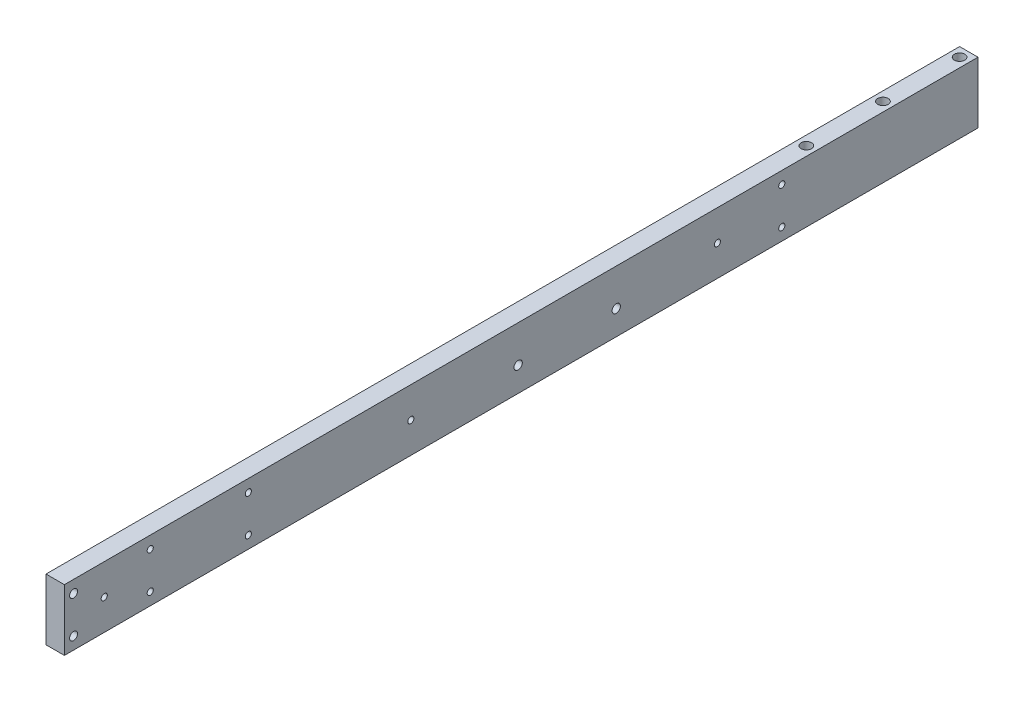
ISO-10303-21;
HEADER;
FILE_DESCRIPTION(('STEP AP214'),'2;1');
FILE_NAME('part.step','',(''),(''),'','','');
FILE_SCHEMA(('AUTOMOTIVE_DESIGN { 1 0 10303 214 1 1 1 1 }'));
ENDSEC;
DATA;
#1=APPLICATION_CONTEXT('core data for automotive mechanical design processes');
#2=APPLICATION_PROTOCOL_DEFINITION('international standard','automotive_design',2000,#1);
#3=PRODUCT_CONTEXT('',#1,'mechanical');
#4=PRODUCT('Part','Part','',(#3));
#5=PRODUCT_RELATED_PRODUCT_CATEGORY('part','',(#4));
#6=PRODUCT_DEFINITION_FORMATION('','',#4);
#7=PRODUCT_DEFINITION_CONTEXT('part definition',#1,'design');
#8=PRODUCT_DEFINITION('design','',#6,#7);
#9=PRODUCT_DEFINITION_SHAPE('','',#8);
#10=(LENGTH_UNIT() NAMED_UNIT(*) SI_UNIT(.MILLI.,.METRE.));
#11=(NAMED_UNIT(*) PLANE_ANGLE_UNIT() SI_UNIT($,.RADIAN.));
#12=(NAMED_UNIT(*) SI_UNIT($,.STERADIAN.) SOLID_ANGLE_UNIT());
#13=UNCERTAINTY_MEASURE_WITH_UNIT(LENGTH_MEASURE(1.E-05),#10,'distance_accuracy_value','');
#14=(GEOMETRIC_REPRESENTATION_CONTEXT(3) GLOBAL_UNCERTAINTY_ASSIGNED_CONTEXT((#13)) GLOBAL_UNIT_ASSIGNED_CONTEXT((#10,
#11,#12)) REPRESENTATION_CONTEXT('',''));
#15=CARTESIAN_POINT('',(0.,0.,0.));
#16=DIRECTION('',(0.,0.,1.));
#17=DIRECTION('',(1.,0.,0.));
#18=AXIS2_PLACEMENT_3D('',#15,#16,#17);
#19=CARTESIAN_POINT('',(0.,0.,-745.));
#20=DIRECTION('',(-1.,0.,0.));
#21=DIRECTION('',(0.,0.,1.));
#22=AXIS2_PLACEMENT_3D('',#19,#20,#21);
#23=PLANE('',#22);
#24=CARTESIAN_POINT('',(0.,20.0000000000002,-450.));
#25=DIRECTION('',(1.,0.,0.));
#26=DIRECTION('',(0.,0.,-1.));
#27=AXIS2_PLACEMENT_3D('',#24,#25,#26);
#28=CIRCLE('',#27,3.4);
#29=CARTESIAN_POINT('',(0.,20.0000000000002,-453.4));
#30=VERTEX_POINT('',#29);
#31=EDGE_CURVE('E305',#30,#30,#28,.T.);
#32=ORIENTED_EDGE('',*,*,#31,.T.);
#33=EDGE_LOOP('',(#32));
#34=FACE_BOUND('',#33,.T.);
#35=CARTESIAN_POINT('',(0.,10.,-150.));
#36=DIRECTION('',(1.,0.,0.));
#37=DIRECTION('',(0.,0.,-1.));
#38=AXIS2_PLACEMENT_3D('',#35,#36,#37);
#39=CIRCLE('',#38,2.5);
#40=CARTESIAN_POINT('',(0.,10.,-152.5));
#41=VERTEX_POINT('',#40);
#42=EDGE_CURVE('E205',#41,#41,#39,.T.);
#43=ORIENTED_EDGE('',*,*,#42,.T.);
#44=EDGE_LOOP('',(#43));
#45=FACE_BOUND('',#44,.T.);
#46=CARTESIAN_POINT('',(0.,10.,-7.49999999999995));
#47=DIRECTION('',(-1.,0.,0.));
#48=DIRECTION('',(0.,0.,1.));
#49=AXIS2_PLACEMENT_3D('',#46,#47,#48);
#50=CIRCLE('',#49,6.);
#51=CARTESIAN_POINT('',(0.,10.,-1.49999999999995));
#52=VERTEX_POINT('',#51);
#53=EDGE_CURVE('E225',#52,#52,#50,.T.);
#54=ORIENTED_EDGE('',*,*,#53,.F.);
#55=EDGE_LOOP('',(#54));
#56=FACE_BOUND('',#55,.T.);
#57=CARTESIAN_POINT('',(0.,40.,-7.49999999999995));
#58=DIRECTION('',(-1.,0.,0.));
#59=DIRECTION('',(0.,0.,1.));
#60=AXIS2_PLACEMENT_3D('',#57,#58,#59);
#61=CIRCLE('',#60,6.);
#62=CARTESIAN_POINT('',(0.,40.,-1.49999999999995));
#63=VERTEX_POINT('',#62);
#64=EDGE_CURVE('E132',#63,#63,#61,.T.);
#65=ORIENTED_EDGE('',*,*,#64,.F.);
#66=EDGE_LOOP('',(#65));
#67=FACE_BOUND('',#66,.T.);
#68=DIRECTION('',(0.,-1.,0.));
#69=VECTOR('',#68,1.);
#70=CARTESIAN_POINT('',(0.,0.,0.));
#71=LINE('',#70,#69);
#72=CARTESIAN_POINT('',(0.,50.,0.));
#73=VERTEX_POINT('',#72);
#74=CARTESIAN_POINT('',(0.,0.,0.));
#75=VERTEX_POINT('',#74);
#76=EDGE_CURVE('E82',#73,#75,#71,.T.);
#77=ORIENTED_EDGE('',*,*,#76,.F.);
#78=DIRECTION('',(0.,0.,1.));
#79=VECTOR('',#78,1.);
#80=CARTESIAN_POINT('',(0.,50.,-745.));
#81=LINE('',#80,#79);
#82=CARTESIAN_POINT('',(0.,50.,-745.));
#83=VERTEX_POINT('',#82);
#84=EDGE_CURVE('E11',#83,#73,#81,.T.);
#85=ORIENTED_EDGE('',*,*,#84,.F.);
#86=DIRECTION('',(0.,-1.,0.));
#87=VECTOR('',#86,1.);
#88=CARTESIAN_POINT('',(0.,0.,-745.));
#89=LINE('',#88,#87);
#90=CARTESIAN_POINT('',(0.,0.,-745.));
#91=VERTEX_POINT('',#90);
#92=EDGE_CURVE('E84',#83,#91,#89,.T.);
#93=ORIENTED_EDGE('',*,*,#92,.T.);
#94=DIRECTION('',(0.,0.,1.));
#95=VECTOR('',#94,1.);
#96=CARTESIAN_POINT('',(0.,0.,-745.));
#97=LINE('',#96,#95);
#98=EDGE_CURVE('E43',#91,#75,#97,.T.);
#99=ORIENTED_EDGE('',*,*,#98,.T.);
#100=EDGE_LOOP('',(#77,#85,#93,#99));
#101=FACE_BOUND('',#100,.T.);
#102=CARTESIAN_POINT('',(0.,40.,-150.));
#103=DIRECTION('',(1.,0.,0.));
#104=DIRECTION('',(0.,0.,-1.));
#105=AXIS2_PLACEMENT_3D('',#102,#103,#104);
#106=CIRCLE('',#105,2.5);
#107=CARTESIAN_POINT('',(0.,40.,-152.5));
#108=VERTEX_POINT('',#107);
#109=EDGE_CURVE('E197',#108,#108,#106,.T.);
#110=ORIENTED_EDGE('',*,*,#109,.T.);
#111=EDGE_LOOP('',(#110));
#112=FACE_BOUND('',#111,.T.);
#113=CARTESIAN_POINT('',(0.,40.,-70.));
#114=DIRECTION('',(1.,0.,0.));
#115=DIRECTION('',(0.,0.,-1.));
#116=AXIS2_PLACEMENT_3D('',#113,#114,#115);
#117=CIRCLE('',#116,2.5);
#118=CARTESIAN_POINT('',(0.,40.,-72.5));
#119=VERTEX_POINT('',#118);
#120=EDGE_CURVE('E134',#119,#119,#117,.T.);
#121=ORIENTED_EDGE('',*,*,#120,.T.);
#122=EDGE_LOOP('',(#121));
#123=FACE_BOUND('',#122,.T.);
#124=CARTESIAN_POINT('',(0.,10.,-70.));
#125=DIRECTION('',(1.,0.,0.));
#126=DIRECTION('',(0.,0.,-1.));
#127=AXIS2_PLACEMENT_3D('',#124,#125,#126);
#128=CIRCLE('',#127,2.5);
#129=CARTESIAN_POINT('',(0.,10.,-72.5));
#130=VERTEX_POINT('',#129);
#131=EDGE_CURVE('E187',#130,#130,#128,.T.);
#132=ORIENTED_EDGE('',*,*,#131,.T.);
#133=EDGE_LOOP('',(#132));
#134=FACE_BOUND('',#133,.T.);
#135=CARTESIAN_POINT('',(0.,10.,-585.));
#136=DIRECTION('',(1.,0.,0.));
#137=DIRECTION('',(0.,0.,-1.));
#138=AXIS2_PLACEMENT_3D('',#135,#136,#137);
#139=CIRCLE('',#138,2.5);
#140=CARTESIAN_POINT('',(0.,10.,-587.5));
#141=VERTEX_POINT('',#140);
#142=EDGE_CURVE('E179',#141,#141,#139,.T.);
#143=ORIENTED_EDGE('',*,*,#142,.T.);
#144=EDGE_LOOP('',(#143));
#145=FACE_BOUND('',#144,.T.);
#146=CARTESIAN_POINT('',(0.,40.,-585.));
#147=DIRECTION('',(1.,0.,0.));
#148=DIRECTION('',(0.,0.,-1.));
#149=AXIS2_PLACEMENT_3D('',#146,#147,#148);
#150=CIRCLE('',#149,2.5);
#151=CARTESIAN_POINT('',(0.,40.,-587.5));
#152=VERTEX_POINT('',#151);
#153=EDGE_CURVE('E171',#152,#152,#150,.T.);
#154=ORIENTED_EDGE('',*,*,#153,.T.);
#155=EDGE_LOOP('',(#154));
#156=FACE_BOUND('',#155,.T.);
#157=CARTESIAN_POINT('',(0.,25.,-32.5));
#158=DIRECTION('',(-1.,0.,0.));
#159=DIRECTION('',(0.,0.,1.));
#160=AXIS2_PLACEMENT_3D('',#157,#158,#159);
#161=CIRCLE('',#160,2.5);
#162=CARTESIAN_POINT('',(0.,25.,-30.));
#163=VERTEX_POINT('',#162);
#164=EDGE_CURVE('E167',#163,#163,#161,.T.);
#165=ORIENTED_EDGE('',*,*,#164,.F.);
#166=EDGE_LOOP('',(#165));
#167=FACE_BOUND('',#166,.T.);
#168=CARTESIAN_POINT('',(0.,25.,-282.5));
#169=DIRECTION('',(-1.,0.,0.));
#170=DIRECTION('',(0.,0.,1.));
#171=AXIS2_PLACEMENT_3D('',#168,#169,#170);
#172=CIRCLE('',#171,2.5);
#173=CARTESIAN_POINT('',(0.,25.,-280.));
#174=VERTEX_POINT('',#173);
#175=EDGE_CURVE('E154',#174,#174,#172,.T.);
#176=ORIENTED_EDGE('',*,*,#175,.F.);
#177=EDGE_LOOP('',(#176));
#178=FACE_BOUND('',#177,.T.);
#179=CARTESIAN_POINT('',(0.,25.,-532.5));
#180=DIRECTION('',(-1.,0.,0.));
#181=DIRECTION('',(0.,0.,1.));
#182=AXIS2_PLACEMENT_3D('',#179,#180,#181);
#183=CIRCLE('',#182,2.5);
#184=CARTESIAN_POINT('',(0.,25.,-530.));
#185=VERTEX_POINT('',#184);
#186=EDGE_CURVE('E145',#185,#185,#183,.T.);
#187=ORIENTED_EDGE('',*,*,#186,.F.);
#188=EDGE_LOOP('',(#187));
#189=FACE_BOUND('',#188,.T.);
#190=CARTESIAN_POINT('',(0.,20.,-370.));
#191=DIRECTION('',(1.,0.,0.));
#192=DIRECTION('',(0.,0.,-1.));
#193=AXIS2_PLACEMENT_3D('',#190,#191,#192);
#194=CIRCLE('',#193,3.4);
#195=CARTESIAN_POINT('',(0.,20.,-373.4));
#196=VERTEX_POINT('',#195);
#197=EDGE_CURVE('E585',#196,#196,#194,.T.);
#198=ORIENTED_EDGE('',*,*,#197,.T.);
#199=EDGE_LOOP('',(#198));
#200=FACE_BOUND('',#199,.T.);
#201=ADVANCED_FACE('F40',(#34,#45,#56,#67,#101,#112,#123,#134,#145,#156,#167,#178,#189,#200),
#23,.T.);
#202=CARTESIAN_POINT('',(15.,0.,-745.));
#203=DIRECTION('',(1.,0.,0.));
#204=DIRECTION('',(0.,0.,-1.));
#205=AXIS2_PLACEMENT_3D('',#202,#203,#204);
#206=PLANE('',#205);
#207=CARTESIAN_POINT('',(15.,20.0000000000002,-450.));
#208=DIRECTION('',(1.,0.,0.));
#209=DIRECTION('',(0.,0.,-1.));
#210=AXIS2_PLACEMENT_3D('',#207,#208,#209);
#211=CIRCLE('',#210,3.39999999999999);
#212=CARTESIAN_POINT('',(15.,20.0000000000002,-453.4));
#213=VERTEX_POINT('',#212);
#214=EDGE_CURVE('E583',#213,#213,#211,.T.);
#215=ORIENTED_EDGE('',*,*,#214,.F.);
#216=EDGE_LOOP('',(#215));
#217=FACE_BOUND('',#216,.T.);
#218=CARTESIAN_POINT('',(15.,20.,-370.));
#219=DIRECTION('',(1.,0.,0.));
#220=DIRECTION('',(0.,0.,-1.));
#221=AXIS2_PLACEMENT_3D('',#218,#219,#220);
#222=CIRCLE('',#221,3.39999999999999);
#223=CARTESIAN_POINT('',(15.,20.,-373.4));
#224=VERTEX_POINT('',#223);
#225=EDGE_CURVE('E157',#224,#224,#222,.T.);
#226=ORIENTED_EDGE('',*,*,#225,.F.);
#227=EDGE_LOOP('',(#226));
#228=FACE_BOUND('',#227,.T.);
#229=CARTESIAN_POINT('',(15.,25.,-282.5));
#230=DIRECTION('',(-1.,0.,0.));
#231=DIRECTION('',(0.,0.,1.));
#232=AXIS2_PLACEMENT_3D('',#229,#230,#231);
#233=CIRCLE('',#232,2.5);
#234=CARTESIAN_POINT('',(15.,25.,-280.));
#235=VERTEX_POINT('',#234);
#236=EDGE_CURVE('E147',#235,#235,#233,.T.);
#237=ORIENTED_EDGE('',*,*,#236,.T.);
#238=EDGE_LOOP('',(#237));
#239=FACE_BOUND('',#238,.T.);
#240=CARTESIAN_POINT('',(15.,25.,-32.5));
#241=DIRECTION('',(-1.,0.,0.));
#242=DIRECTION('',(0.,0.,1.));
#243=AXIS2_PLACEMENT_3D('',#240,#241,#242);
#244=CIRCLE('',#243,2.5);
#245=CARTESIAN_POINT('',(15.,25.,-30.));
#246=VERTEX_POINT('',#245);
#247=EDGE_CURVE('E163',#246,#246,#244,.T.);
#248=ORIENTED_EDGE('',*,*,#247,.T.);
#249=EDGE_LOOP('',(#248));
#250=FACE_BOUND('',#249,.T.);
#251=CARTESIAN_POINT('',(15.,40.,-585.));
#252=DIRECTION('',(1.,0.,0.));
#253=DIRECTION('',(0.,0.,-1.));
#254=AXIS2_PLACEMENT_3D('',#251,#252,#253);
#255=CIRCLE('',#254,2.49999999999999);
#256=CARTESIAN_POINT('',(15.,40.,-587.5));
#257=VERTEX_POINT('',#256);
#258=EDGE_CURVE('E175',#257,#257,#255,.T.);
#259=ORIENTED_EDGE('',*,*,#258,.F.);
#260=EDGE_LOOP('',(#259));
#261=FACE_BOUND('',#260,.T.);
#262=CARTESIAN_POINT('',(15.,10.,-585.));
#263=DIRECTION('',(1.,0.,0.));
#264=DIRECTION('',(0.,0.,-1.));
#265=AXIS2_PLACEMENT_3D('',#262,#263,#264);
#266=CIRCLE('',#265,2.49999999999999);
#267=CARTESIAN_POINT('',(15.,10.,-587.5));
#268=VERTEX_POINT('',#267);
#269=EDGE_CURVE('E183',#268,#268,#266,.T.);
#270=ORIENTED_EDGE('',*,*,#269,.F.);
#271=EDGE_LOOP('',(#270));
#272=FACE_BOUND('',#271,.T.);
#273=CARTESIAN_POINT('',(15.,10.,-70.));
#274=DIRECTION('',(1.,0.,0.));
#275=DIRECTION('',(0.,0.,-1.));
#276=AXIS2_PLACEMENT_3D('',#273,#274,#275);
#277=CIRCLE('',#276,2.49999999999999);
#278=CARTESIAN_POINT('',(15.,10.,-72.4999999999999));
#279=VERTEX_POINT('',#278);
#280=EDGE_CURVE('E137',#279,#279,#277,.T.);
#281=ORIENTED_EDGE('',*,*,#280,.F.);
#282=EDGE_LOOP('',(#281));
#283=FACE_BOUND('',#282,.T.);
#284=CARTESIAN_POINT('',(15.,40.,-70.));
#285=DIRECTION('',(1.,0.,0.));
#286=DIRECTION('',(0.,0.,-1.));
#287=AXIS2_PLACEMENT_3D('',#284,#285,#286);
#288=CIRCLE('',#287,2.49999999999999);
#289=CARTESIAN_POINT('',(15.,40.,-72.4999999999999));
#290=VERTEX_POINT('',#289);
#291=EDGE_CURVE('E136',#290,#290,#288,.T.);
#292=ORIENTED_EDGE('',*,*,#291,.F.);
#293=EDGE_LOOP('',(#292));
#294=FACE_BOUND('',#293,.T.);
#295=CARTESIAN_POINT('',(15.,40.,-150.));
#296=DIRECTION('',(1.,0.,0.));
#297=DIRECTION('',(0.,0.,-1.));
#298=AXIS2_PLACEMENT_3D('',#295,#296,#297);
#299=CIRCLE('',#298,2.49999999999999);
#300=CARTESIAN_POINT('',(15.,40.,-152.5));
#301=VERTEX_POINT('',#300);
#302=EDGE_CURVE('E201',#301,#301,#299,.T.);
#303=ORIENTED_EDGE('',*,*,#302,.F.);
#304=EDGE_LOOP('',(#303));
#305=FACE_BOUND('',#304,.T.);
#306=CARTESIAN_POINT('',(15.,10.,-150.));
#307=DIRECTION('',(1.,0.,0.));
#308=DIRECTION('',(0.,0.,-1.));
#309=AXIS2_PLACEMENT_3D('',#306,#307,#308);
#310=CIRCLE('',#309,2.49999999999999);
#311=CARTESIAN_POINT('',(15.,10.,-152.5));
#312=VERTEX_POINT('',#311);
#313=EDGE_CURVE('E209',#312,#312,#310,.T.);
#314=ORIENTED_EDGE('',*,*,#313,.F.);
#315=EDGE_LOOP('',(#314));
#316=FACE_BOUND('',#315,.T.);
#317=DIRECTION('',(0.,1.,0.));
#318=VECTOR('',#317,1.);
#319=CARTESIAN_POINT('',(15.,0.,0.));
#320=LINE('',#319,#318);
#321=CARTESIAN_POINT('',(15.,0.,0.));
#322=VERTEX_POINT('',#321);
#323=CARTESIAN_POINT('',(15.,50.,0.));
#324=VERTEX_POINT('',#323);
#325=EDGE_CURVE('E99',#322,#324,#320,.T.);
#326=ORIENTED_EDGE('',*,*,#325,.F.);
#327=DIRECTION('',(0.,0.,1.));
#328=VECTOR('',#327,1.);
#329=CARTESIAN_POINT('',(15.,0.,-745.));
#330=LINE('',#329,#328);
#331=CARTESIAN_POINT('',(15.,0.,-745.));
#332=VERTEX_POINT('',#331);
#333=EDGE_CURVE('E89',#332,#322,#330,.T.);
#334=ORIENTED_EDGE('',*,*,#333,.F.);
#335=DIRECTION('',(0.,1.,0.));
#336=VECTOR('',#335,1.);
#337=CARTESIAN_POINT('',(15.,0.,-745.));
#338=LINE('',#337,#336);
#339=CARTESIAN_POINT('',(15.,50.,-745.));
#340=VERTEX_POINT('',#339);
#341=EDGE_CURVE('E123',#332,#340,#338,.T.);
#342=ORIENTED_EDGE('',*,*,#341,.T.);
#343=DIRECTION('',(0.,0.,1.));
#344=VECTOR('',#343,1.);
#345=CARTESIAN_POINT('',(15.,50.,-745.));
#346=LINE('',#345,#344);
#347=EDGE_CURVE('E49',#340,#324,#346,.T.);
#348=ORIENTED_EDGE('',*,*,#347,.T.);
#349=EDGE_LOOP('',(#326,#334,#342,#348));
#350=FACE_BOUND('',#349,.T.);
#351=CARTESIAN_POINT('',(15.,40.,-7.49999999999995));
#352=DIRECTION('',(-1.,0.,0.));
#353=DIRECTION('',(0.,0.,1.));
#354=AXIS2_PLACEMENT_3D('',#351,#352,#353);
#355=CIRCLE('',#354,3.25);
#356=CARTESIAN_POINT('',(15.,40.,-4.24999999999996));
#357=VERTEX_POINT('',#356);
#358=EDGE_CURVE('E229',#357,#357,#355,.T.);
#359=ORIENTED_EDGE('',*,*,#358,.T.);
#360=EDGE_LOOP('',(#359));
#361=FACE_BOUND('',#360,.T.);
#362=CARTESIAN_POINT('',(15.,10.,-7.49999999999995));
#363=DIRECTION('',(-1.,0.,0.));
#364=DIRECTION('',(0.,0.,1.));
#365=AXIS2_PLACEMENT_3D('',#362,#363,#364);
#366=CIRCLE('',#365,3.25);
#367=CARTESIAN_POINT('',(15.,10.,-4.24999999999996));
#368=VERTEX_POINT('',#367);
#369=EDGE_CURVE('E213',#368,#368,#366,.T.);
#370=ORIENTED_EDGE('',*,*,#369,.T.);
#371=EDGE_LOOP('',(#370));
#372=FACE_BOUND('',#371,.T.);
#373=CARTESIAN_POINT('',(15.,25.,-532.5));
#374=DIRECTION('',(-1.,0.,0.));
#375=DIRECTION('',(0.,0.,1.));
#376=AXIS2_PLACEMENT_3D('',#373,#374,#375);
#377=CIRCLE('',#376,2.5);
#378=CARTESIAN_POINT('',(15.,25.,-530.));
#379=VERTEX_POINT('',#378);
#380=EDGE_CURVE('E148',#379,#379,#377,.T.);
#381=ORIENTED_EDGE('',*,*,#380,.T.);
#382=EDGE_LOOP('',(#381));
#383=FACE_BOUND('',#382,.T.);
#384=ADVANCED_FACE('F272',(#217,#228,#239,#250,#261,#272,#283,#294,#305,#316,#350,#361,#372,
#383),#206,.T.);
#385=CARTESIAN_POINT('',(0.,0.,-745.));
#386=DIRECTION('',(0.,-1.,0.));
#387=DIRECTION('',(0.,0.,-1.));
#388=AXIS2_PLACEMENT_3D('',#385,#386,#387);
#389=PLANE('',#388);
#390=CARTESIAN_POINT('',(7.49999999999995,0.,-675.));
#391=DIRECTION('',(0.,1.,0.));
#392=DIRECTION('',(0.,0.,1.));
#393=AXIS2_PLACEMENT_3D('',#390,#391,#392);
#394=CIRCLE('',#393,4.24999999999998);
#395=CARTESIAN_POINT('',(7.49999999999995,0.,-670.75));
#396=VERTEX_POINT('',#395);
#397=EDGE_CURVE('E143',#396,#396,#394,.T.);
#398=ORIENTED_EDGE('',*,*,#397,.T.);
#399=EDGE_LOOP('',(#398));
#400=FACE_BOUND('',#399,.T.);
#401=CARTESIAN_POINT('',(7.49999999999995,0.,-737.5));
#402=DIRECTION('',(0.,1.,0.));
#403=DIRECTION('',(0.,0.,1.));
#404=AXIS2_PLACEMENT_3D('',#401,#402,#403);
#405=CIRCLE('',#404,4.24999999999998);
#406=CARTESIAN_POINT('',(7.49999999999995,0.,-733.25));
#407=VERTEX_POINT('',#406);
#408=EDGE_CURVE('E142',#407,#407,#405,.T.);
#409=ORIENTED_EDGE('',*,*,#408,.T.);
#410=EDGE_LOOP('',(#409));
#411=FACE_BOUND('',#410,.T.);
#412=DIRECTION('',(1.,0.,0.));
#413=VECTOR('',#412,1.);
#414=CARTESIAN_POINT('',(0.,0.,0.));
#415=LINE('',#414,#413);
#416=EDGE_CURVE('E92',#75,#322,#415,.T.);
#417=ORIENTED_EDGE('',*,*,#416,.F.);
#418=ORIENTED_EDGE('',*,*,#98,.F.);
#419=DIRECTION('',(1.,0.,0.));
#420=VECTOR('',#419,1.);
#421=CARTESIAN_POINT('',(0.,0.,-745.));
#422=LINE('',#421,#420);
#423=EDGE_CURVE('E120',#91,#332,#422,.T.);
#424=ORIENTED_EDGE('',*,*,#423,.T.);
#425=ORIENTED_EDGE('',*,*,#333,.T.);
#426=EDGE_LOOP('',(#417,#418,#424,#425));
#427=FACE_BOUND('',#426,.T.);
#428=CARTESIAN_POINT('',(7.49999999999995,0.,-612.5));
#429=DIRECTION('',(0.,1.,0.));
#430=DIRECTION('',(0.,0.,1.));
#431=AXIS2_PLACEMENT_3D('',#428,#429,#430);
#432=CIRCLE('',#431,4.24999999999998);
#433=CARTESIAN_POINT('',(7.49999999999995,0.,-608.25));
#434=VERTEX_POINT('',#433);
#435=EDGE_CURVE('E110',#434,#434,#432,.T.);
#436=ORIENTED_EDGE('',*,*,#435,.T.);
#437=EDGE_LOOP('',(#436));
#438=FACE_BOUND('',#437,.T.);
#439=ADVANCED_FACE('F93',(#400,#411,#427,#438),#389,.T.);
#440=CARTESIAN_POINT('',(0.,50.,-745.));
#441=DIRECTION('',(0.,1.,0.));
#442=DIRECTION('',(0.,0.,1.));
#443=AXIS2_PLACEMENT_3D('',#440,#441,#442);
#444=PLANE('',#443);
#445=CARTESIAN_POINT('',(7.49999999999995,50.,-675.));
#446=DIRECTION('',(0.,1.,0.));
#447=DIRECTION('',(0.,0.,1.));
#448=AXIS2_PLACEMENT_3D('',#445,#446,#447);
#449=CIRCLE('',#448,4.24999999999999);
#450=CARTESIAN_POINT('',(7.49999999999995,50.,-670.75));
#451=VERTEX_POINT('',#450);
#452=EDGE_CURVE('E140',#451,#451,#449,.T.);
#453=ORIENTED_EDGE('',*,*,#452,.F.);
#454=EDGE_LOOP('',(#453));
#455=FACE_BOUND('',#454,.T.);
#456=CARTESIAN_POINT('',(7.49999999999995,50.,-737.5));
#457=DIRECTION('',(0.,1.,0.));
#458=DIRECTION('',(0.,0.,1.));
#459=AXIS2_PLACEMENT_3D('',#456,#457,#458);
#460=CIRCLE('',#459,4.24999999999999);
#461=CARTESIAN_POINT('',(7.49999999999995,50.,-733.25));
#462=VERTEX_POINT('',#461);
#463=EDGE_CURVE('E249',#462,#462,#460,.T.);
#464=ORIENTED_EDGE('',*,*,#463,.F.);
#465=EDGE_LOOP('',(#464));
#466=FACE_BOUND('',#465,.T.);
#467=CARTESIAN_POINT('',(7.49999999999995,50.,-612.5));
#468=DIRECTION('',(0.,1.,0.));
#469=DIRECTION('',(0.,0.,1.));
#470=AXIS2_PLACEMENT_3D('',#467,#468,#469);
#471=CIRCLE('',#470,4.24999999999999);
#472=CARTESIAN_POINT('',(7.49999999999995,50.,-608.25));
#473=VERTEX_POINT('',#472);
#474=EDGE_CURVE('E104',#473,#473,#471,.T.);
#475=ORIENTED_EDGE('',*,*,#474,.F.);
#476=EDGE_LOOP('',(#475));
#477=FACE_BOUND('',#476,.T.);
#478=DIRECTION('',(-1.,0.,0.));
#479=VECTOR('',#478,1.);
#480=CARTESIAN_POINT('',(0.,50.,0.));
#481=LINE('',#480,#479);
#482=EDGE_CURVE('E102',#324,#73,#481,.T.);
#483=ORIENTED_EDGE('',*,*,#482,.F.);
#484=ORIENTED_EDGE('',*,*,#347,.F.);
#485=DIRECTION('',(-1.,0.,0.));
#486=VECTOR('',#485,1.);
#487=CARTESIAN_POINT('',(0.,50.,-745.));
#488=LINE('',#487,#486);
#489=EDGE_CURVE('E90',#340,#83,#488,.T.);
#490=ORIENTED_EDGE('',*,*,#489,.T.);
#491=ORIENTED_EDGE('',*,*,#84,.T.);
#492=EDGE_LOOP('',(#483,#484,#490,#491));
#493=FACE_BOUND('',#492,.T.);
#494=ADVANCED_FACE('F263',(#455,#466,#477,#493),#444,.T.);
#495=CARTESIAN_POINT('',(0.,50.,-745.));
#496=DIRECTION('',(0.,0.,-1.));
#497=DIRECTION('',(-1.,0.,0.));
#498=AXIS2_PLACEMENT_3D('',#495,#496,#497);
#499=PLANE('',#498);
#500=ORIENTED_EDGE('',*,*,#92,.F.);
#501=ORIENTED_EDGE('',*,*,#489,.F.);
#502=ORIENTED_EDGE('',*,*,#341,.F.);
#503=ORIENTED_EDGE('',*,*,#423,.F.);
#504=EDGE_LOOP('',(#500,#501,#502,#503));
#505=FACE_BOUND('',#504,.T.);
#506=ADVANCED_FACE('F265',(#505),#499,.T.);
#507=CARTESIAN_POINT('',(0.,50.,0.));
#508=DIRECTION('',(0.,0.,-1.));
#509=DIRECTION('',(-1.,0.,0.));
#510=AXIS2_PLACEMENT_3D('',#507,#508,#509);
#511=PLANE('',#510);
#512=ORIENTED_EDGE('',*,*,#76,.T.);
#513=ORIENTED_EDGE('',*,*,#416,.T.);
#514=ORIENTED_EDGE('',*,*,#325,.T.);
#515=ORIENTED_EDGE('',*,*,#482,.T.);
#516=EDGE_LOOP('',(#512,#513,#514,#515));
#517=FACE_BOUND('',#516,.T.);
#518=ADVANCED_FACE('F101',(#517),#511,.F.);
#519=CARTESIAN_POINT('',(7.49999999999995,50.,-612.5));
#520=DIRECTION('',(0.,1.,0.));
#521=DIRECTION('',(0.,0.,1.));
#522=AXIS2_PLACEMENT_3D('',#519,#520,#521);
#523=CYLINDRICAL_SURFACE('',#522,4.24999999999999);
#524=ORIENTED_EDGE('',*,*,#435,.F.);
#525=EDGE_LOOP('',(#524));
#526=FACE_BOUND('',#525,.T.);
#527=ORIENTED_EDGE('',*,*,#474,.T.);
#528=EDGE_LOOP('',(#527));
#529=FACE_BOUND('',#528,.T.);
#530=ADVANCED_FACE('F256',(#526,#529),#523,.F.);
#531=CARTESIAN_POINT('',(7.49999999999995,50.,-737.5));
#532=DIRECTION('',(0.,1.,0.));
#533=DIRECTION('',(0.,0.,1.));
#534=AXIS2_PLACEMENT_3D('',#531,#532,#533);
#535=CYLINDRICAL_SURFACE('',#534,4.24999999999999);
#536=ORIENTED_EDGE('',*,*,#408,.F.);
#537=EDGE_LOOP('',(#536));
#538=FACE_BOUND('',#537,.T.);
#539=ORIENTED_EDGE('',*,*,#463,.T.);
#540=EDGE_LOOP('',(#539));
#541=FACE_BOUND('',#540,.T.);
#542=ADVANCED_FACE('F259',(#538,#541),#535,.F.);
#543=CARTESIAN_POINT('',(7.49999999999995,50.,-675.));
#544=DIRECTION('',(0.,1.,0.));
#545=DIRECTION('',(0.,0.,1.));
#546=AXIS2_PLACEMENT_3D('',#543,#544,#545);
#547=CYLINDRICAL_SURFACE('',#546,4.24999999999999);
#548=ORIENTED_EDGE('',*,*,#397,.F.);
#549=EDGE_LOOP('',(#548));
#550=FACE_BOUND('',#549,.T.);
#551=ORIENTED_EDGE('',*,*,#452,.T.);
#552=EDGE_LOOP('',(#551));
#553=FACE_BOUND('',#552,.T.);
#554=ADVANCED_FACE('F315',(#550,#553),#547,.F.);
#555=CARTESIAN_POINT('',(0.,40.,-7.49999999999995));
#556=DIRECTION('',(-1.,0.,0.));
#557=DIRECTION('',(0.,0.,1.));
#558=AXIS2_PLACEMENT_3D('',#555,#556,#557);
#559=CYLINDRICAL_SURFACE('',#558,6.);
#560=CARTESIAN_POINT('',(6.00000000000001,40.,-7.49999999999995));
#561=DIRECTION('',(-1.,0.,0.));
#562=DIRECTION('',(0.,0.,1.));
#563=AXIS2_PLACEMENT_3D('',#560,#561,#562);
#564=CIRCLE('',#563,6.);
#565=CARTESIAN_POINT('',(6.00000000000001,40.,-1.49999999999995));
#566=VERTEX_POINT('',#565);
#567=EDGE_CURVE('E237',#566,#566,#564,.T.);
#568=ORIENTED_EDGE('',*,*,#567,.F.);
#569=EDGE_LOOP('',(#568));
#570=FACE_BOUND('',#569,.T.);
#571=ORIENTED_EDGE('',*,*,#64,.T.);
#572=EDGE_LOOP('',(#571));
#573=FACE_BOUND('',#572,.T.);
#574=ADVANCED_FACE('F312',(#570,#573),#559,.F.);
#575=CARTESIAN_POINT('',(6.00000000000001,43.25,-7.49999999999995));
#576=DIRECTION('',(1.,0.,0.));
#577=DIRECTION('',(0.,0.,-1.));
#578=AXIS2_PLACEMENT_3D('',#575,#576,#577);
#579=PLANE('',#578);
#580=CARTESIAN_POINT('',(6.00000000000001,40.,-7.49999999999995));
#581=DIRECTION('',(-1.,0.,0.));
#582=DIRECTION('',(0.,0.,1.));
#583=AXIS2_PLACEMENT_3D('',#580,#581,#582);
#584=CIRCLE('',#583,3.25);
#585=CARTESIAN_POINT('',(6.00000000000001,40.,-4.24999999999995));
#586=VERTEX_POINT('',#585);
#587=EDGE_CURVE('E233',#586,#586,#584,.T.);
#588=ORIENTED_EDGE('',*,*,#587,.F.);
#589=EDGE_LOOP('',(#588));
#590=FACE_BOUND('',#589,.T.);
#591=ORIENTED_EDGE('',*,*,#567,.T.);
#592=EDGE_LOOP('',(#591));
#593=FACE_BOUND('',#592,.T.);
#594=ADVANCED_FACE('F314',(#590,#593),#579,.F.);
#595=CARTESIAN_POINT('',(0.,40.,-7.49999999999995));
#596=DIRECTION('',(-1.,0.,0.));
#597=DIRECTION('',(0.,0.,1.));
#598=AXIS2_PLACEMENT_3D('',#595,#596,#597);
#599=CYLINDRICAL_SURFACE('',#598,3.25);
#600=ORIENTED_EDGE('',*,*,#358,.F.);
#601=EDGE_LOOP('',(#600));
#602=FACE_BOUND('',#601,.T.);
#603=ORIENTED_EDGE('',*,*,#587,.T.);
#604=EDGE_LOOP('',(#603));
#605=FACE_BOUND('',#604,.T.);
#606=ADVANCED_FACE('F322',(#602,#605),#599,.F.);
#607=CARTESIAN_POINT('',(0.,10.,-7.49999999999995));
#608=DIRECTION('',(-1.,0.,0.));
#609=DIRECTION('',(0.,0.,1.));
#610=AXIS2_PLACEMENT_3D('',#607,#608,#609);
#611=CYLINDRICAL_SURFACE('',#610,6.);
#612=CARTESIAN_POINT('',(6.00000000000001,10.,-7.49999999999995));
#613=DIRECTION('',(-1.,0.,0.));
#614=DIRECTION('',(0.,0.,1.));
#615=AXIS2_PLACEMENT_3D('',#612,#613,#614);
#616=CIRCLE('',#615,6.);
#617=CARTESIAN_POINT('',(6.00000000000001,10.,-1.49999999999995));
#618=VERTEX_POINT('',#617);
#619=EDGE_CURVE('E221',#618,#618,#616,.T.);
#620=ORIENTED_EDGE('',*,*,#619,.F.);
#621=EDGE_LOOP('',(#620));
#622=FACE_BOUND('',#621,.T.);
#623=ORIENTED_EDGE('',*,*,#53,.T.);
#624=EDGE_LOOP('',(#623));
#625=FACE_BOUND('',#624,.T.);
#626=ADVANCED_FACE('F390',(#622,#625),#611,.F.);
#627=CARTESIAN_POINT('',(6.00000000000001,13.25,-7.49999999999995));
#628=DIRECTION('',(1.,0.,0.));
#629=DIRECTION('',(0.,0.,-1.));
#630=AXIS2_PLACEMENT_3D('',#627,#628,#629);
#631=PLANE('',#630);
#632=CARTESIAN_POINT('',(6.00000000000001,10.,-7.49999999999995));
#633=DIRECTION('',(-1.,0.,0.));
#634=DIRECTION('',(0.,0.,1.));
#635=AXIS2_PLACEMENT_3D('',#632,#633,#634);
#636=CIRCLE('',#635,3.25);
#637=CARTESIAN_POINT('',(6.00000000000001,10.,-4.24999999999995));
#638=VERTEX_POINT('',#637);
#639=EDGE_CURVE('E217',#638,#638,#636,.T.);
#640=ORIENTED_EDGE('',*,*,#639,.F.);
#641=EDGE_LOOP('',(#640));
#642=FACE_BOUND('',#641,.T.);
#643=ORIENTED_EDGE('',*,*,#619,.T.);
#644=EDGE_LOOP('',(#643));
#645=FACE_BOUND('',#644,.T.);
#646=ADVANCED_FACE('F398',(#642,#645),#631,.F.);
#647=CARTESIAN_POINT('',(0.,10.,-7.49999999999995));
#648=DIRECTION('',(-1.,0.,0.));
#649=DIRECTION('',(0.,0.,1.));
#650=AXIS2_PLACEMENT_3D('',#647,#648,#649);
#651=CYLINDRICAL_SURFACE('',#650,3.25);
#652=ORIENTED_EDGE('',*,*,#369,.F.);
#653=EDGE_LOOP('',(#652));
#654=FACE_BOUND('',#653,.T.);
#655=ORIENTED_EDGE('',*,*,#639,.T.);
#656=EDGE_LOOP('',(#655));
#657=FACE_BOUND('',#656,.T.);
#658=ADVANCED_FACE('F407',(#654,#657),#651,.F.);
#659=CARTESIAN_POINT('',(15.,10.,-150.));
#660=DIRECTION('',(1.,0.,0.));
#661=DIRECTION('',(0.,0.,-1.));
#662=AXIS2_PLACEMENT_3D('',#659,#660,#661);
#663=CYLINDRICAL_SURFACE('',#662,2.49999999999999);
#664=ORIENTED_EDGE('',*,*,#42,.F.);
#665=EDGE_LOOP('',(#664));
#666=FACE_BOUND('',#665,.T.);
#667=ORIENTED_EDGE('',*,*,#313,.T.);
#668=EDGE_LOOP('',(#667));
#669=FACE_BOUND('',#668,.T.);
#670=ADVANCED_FACE('F416',(#666,#669),#663,.F.);
#671=CARTESIAN_POINT('',(15.,40.,-150.));
#672=DIRECTION('',(1.,0.,0.));
#673=DIRECTION('',(0.,0.,-1.));
#674=AXIS2_PLACEMENT_3D('',#671,#672,#673);
#675=CYLINDRICAL_SURFACE('',#674,2.49999999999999);
#676=ORIENTED_EDGE('',*,*,#109,.F.);
#677=EDGE_LOOP('',(#676));
#678=FACE_BOUND('',#677,.T.);
#679=ORIENTED_EDGE('',*,*,#302,.T.);
#680=EDGE_LOOP('',(#679));
#681=FACE_BOUND('',#680,.T.);
#682=ADVANCED_FACE('F426',(#678,#681),#675,.F.);
#683=CARTESIAN_POINT('',(15.,40.,-70.));
#684=DIRECTION('',(1.,0.,0.));
#685=DIRECTION('',(0.,0.,-1.));
#686=AXIS2_PLACEMENT_3D('',#683,#684,#685);
#687=CYLINDRICAL_SURFACE('',#686,2.49999999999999);
#688=ORIENTED_EDGE('',*,*,#120,.F.);
#689=EDGE_LOOP('',(#688));
#690=FACE_BOUND('',#689,.T.);
#691=ORIENTED_EDGE('',*,*,#291,.T.);
#692=EDGE_LOOP('',(#691));
#693=FACE_BOUND('',#692,.T.);
#694=ADVANCED_FACE('F436',(#690,#693),#687,.F.);
#695=CARTESIAN_POINT('',(15.,10.,-70.));
#696=DIRECTION('',(1.,0.,0.));
#697=DIRECTION('',(0.,0.,-1.));
#698=AXIS2_PLACEMENT_3D('',#695,#696,#697);
#699=CYLINDRICAL_SURFACE('',#698,2.49999999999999);
#700=ORIENTED_EDGE('',*,*,#131,.F.);
#701=EDGE_LOOP('',(#700));
#702=FACE_BOUND('',#701,.T.);
#703=ORIENTED_EDGE('',*,*,#280,.T.);
#704=EDGE_LOOP('',(#703));
#705=FACE_BOUND('',#704,.T.);
#706=ADVANCED_FACE('F446',(#702,#705),#699,.F.);
#707=CARTESIAN_POINT('',(15.,10.,-585.));
#708=DIRECTION('',(1.,0.,0.));
#709=DIRECTION('',(0.,0.,-1.));
#710=AXIS2_PLACEMENT_3D('',#707,#708,#709);
#711=CYLINDRICAL_SURFACE('',#710,2.49999999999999);
#712=ORIENTED_EDGE('',*,*,#142,.F.);
#713=EDGE_LOOP('',(#712));
#714=FACE_BOUND('',#713,.T.);
#715=ORIENTED_EDGE('',*,*,#269,.T.);
#716=EDGE_LOOP('',(#715));
#717=FACE_BOUND('',#716,.T.);
#718=ADVANCED_FACE('F456',(#714,#717),#711,.F.);
#719=CARTESIAN_POINT('',(15.,40.,-585.));
#720=DIRECTION('',(1.,0.,0.));
#721=DIRECTION('',(0.,0.,-1.));
#722=AXIS2_PLACEMENT_3D('',#719,#720,#721);
#723=CYLINDRICAL_SURFACE('',#722,2.49999999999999);
#724=ORIENTED_EDGE('',*,*,#153,.F.);
#725=EDGE_LOOP('',(#724));
#726=FACE_BOUND('',#725,.T.);
#727=ORIENTED_EDGE('',*,*,#258,.T.);
#728=EDGE_LOOP('',(#727));
#729=FACE_BOUND('',#728,.T.);
#730=ADVANCED_FACE('F466',(#726,#729),#723,.F.);
#731=CARTESIAN_POINT('',(0.,25.,-32.5));
#732=DIRECTION('',(-1.,0.,0.));
#733=DIRECTION('',(0.,0.,1.));
#734=AXIS2_PLACEMENT_3D('',#731,#732,#733);
#735=CYLINDRICAL_SURFACE('',#734,2.5);
#736=ORIENTED_EDGE('',*,*,#247,.F.);
#737=EDGE_LOOP('',(#736));
#738=FACE_BOUND('',#737,.T.);
#739=ORIENTED_EDGE('',*,*,#164,.T.);
#740=EDGE_LOOP('',(#739));
#741=FACE_BOUND('',#740,.T.);
#742=ADVANCED_FACE('F295',(#738,#741),#735,.F.);
#743=CARTESIAN_POINT('',(0.,25.,-282.5));
#744=DIRECTION('',(-1.,0.,0.));
#745=DIRECTION('',(0.,0.,1.));
#746=AXIS2_PLACEMENT_3D('',#743,#744,#745);
#747=CYLINDRICAL_SURFACE('',#746,2.5);
#748=ORIENTED_EDGE('',*,*,#236,.F.);
#749=EDGE_LOOP('',(#748));
#750=FACE_BOUND('',#749,.T.);
#751=ORIENTED_EDGE('',*,*,#175,.T.);
#752=EDGE_LOOP('',(#751));
#753=FACE_BOUND('',#752,.T.);
#754=ADVANCED_FACE('F286',(#750,#753),#747,.F.);
#755=CARTESIAN_POINT('',(0.,25.,-532.5));
#756=DIRECTION('',(-1.,0.,0.));
#757=DIRECTION('',(0.,0.,1.));
#758=AXIS2_PLACEMENT_3D('',#755,#756,#757);
#759=CYLINDRICAL_SURFACE('',#758,2.5);
#760=ORIENTED_EDGE('',*,*,#380,.F.);
#761=EDGE_LOOP('',(#760));
#762=FACE_BOUND('',#761,.T.);
#763=ORIENTED_EDGE('',*,*,#186,.T.);
#764=EDGE_LOOP('',(#763));
#765=FACE_BOUND('',#764,.T.);
#766=ADVANCED_FACE('F283',(#762,#765),#759,.F.);
#767=CARTESIAN_POINT('',(15.,20.,-370.));
#768=DIRECTION('',(1.,0.,0.));
#769=DIRECTION('',(0.,0.,-1.));
#770=AXIS2_PLACEMENT_3D('',#767,#768,#769);
#771=CYLINDRICAL_SURFACE('',#770,3.39999999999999);
#772=ORIENTED_EDGE('',*,*,#197,.F.);
#773=EDGE_LOOP('',(#772));
#774=FACE_BOUND('',#773,.T.);
#775=ORIENTED_EDGE('',*,*,#225,.T.);
#776=EDGE_LOOP('',(#775));
#777=FACE_BOUND('',#776,.T.);
#778=ADVANCED_FACE('F285',(#774,#777),#771,.F.);
#779=CARTESIAN_POINT('',(15.,20.0000000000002,-450.));
#780=DIRECTION('',(1.,0.,0.));
#781=DIRECTION('',(0.,0.,-1.));
#782=AXIS2_PLACEMENT_3D('',#779,#780,#781);
#783=CYLINDRICAL_SURFACE('',#782,3.39999999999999);
#784=ORIENTED_EDGE('',*,*,#31,.F.);
#785=EDGE_LOOP('',(#784));
#786=FACE_BOUND('',#785,.T.);
#787=ORIENTED_EDGE('',*,*,#214,.T.);
#788=EDGE_LOOP('',(#787));
#789=FACE_BOUND('',#788,.T.);
#790=ADVANCED_FACE('F292',(#786,#789),#783,.F.);
#791=CLOSED_SHELL('',(#201,#384,#439,#494,#506,#518,#530,#542,#554,#574,#594,#606,#626,#646,
#658,#670,#682,#694,#706,#718,#730,#742,#754,#766,#778,#790));
#792=MANIFOLD_SOLID_BREP('B2',#791);
#793=ADVANCED_BREP_SHAPE_REPRESENTATION('',(#18,#792),#14);
#794=SHAPE_DEFINITION_REPRESENTATION(#9,#793);
ENDSEC;
END-ISO-10303-21;
